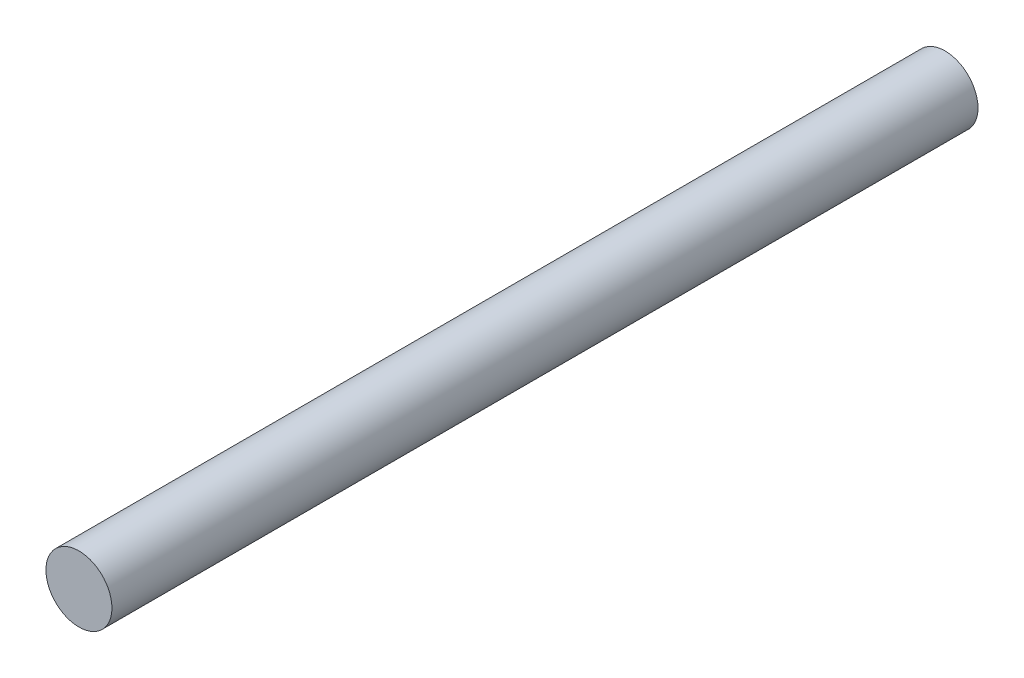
from build123d import *

# Parameters (mm, degrees)
SKETCH1_R           = 5.715
BOSS_EXTRUDE1_DEPTH = 150


with BuildPart() as part:
    # Sketch1 → Boss-Extrude1 (new body)
    with BuildSketch(Plane.XY):
        Circle(SKETCH1_R)
    extrude(amount=BOSS_EXTRUDE1_DEPTH)


solid = part.part
